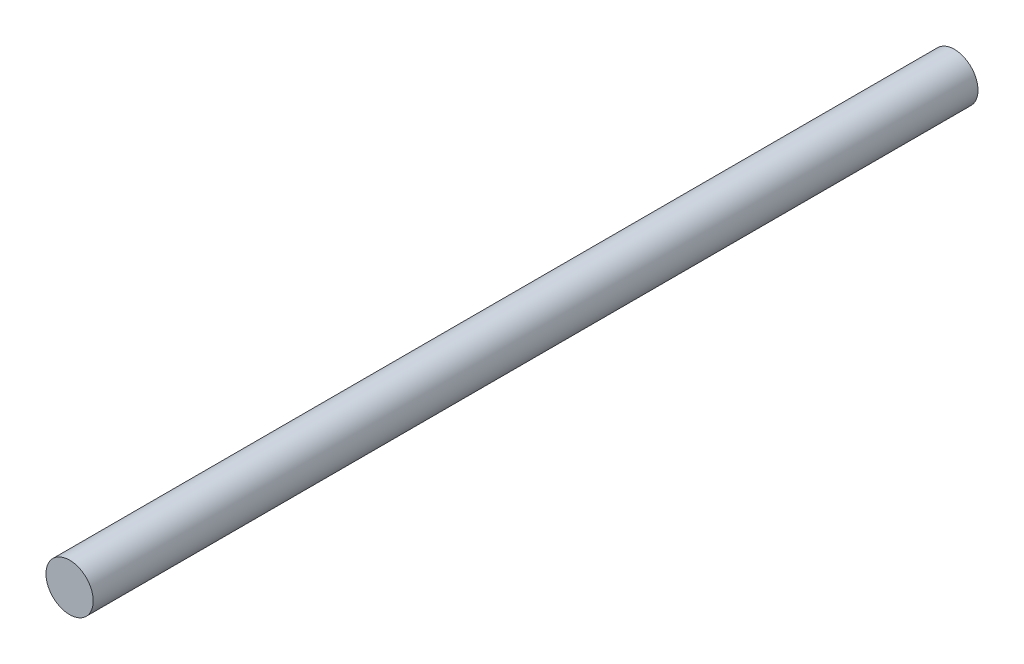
from build123d import *

# Parameters (mm, degrees)
SKETCH1_R          = 2.3749
BASE_EXTRUDE_DEPTH = 88.9


with BuildPart() as part:
    # Sketch1 → Base-Extrude (new body)
    with BuildSketch(Plane.XY):
        Circle(SKETCH1_R)
    extrude(amount=BASE_EXTRUDE_DEPTH)


solid = part.part
